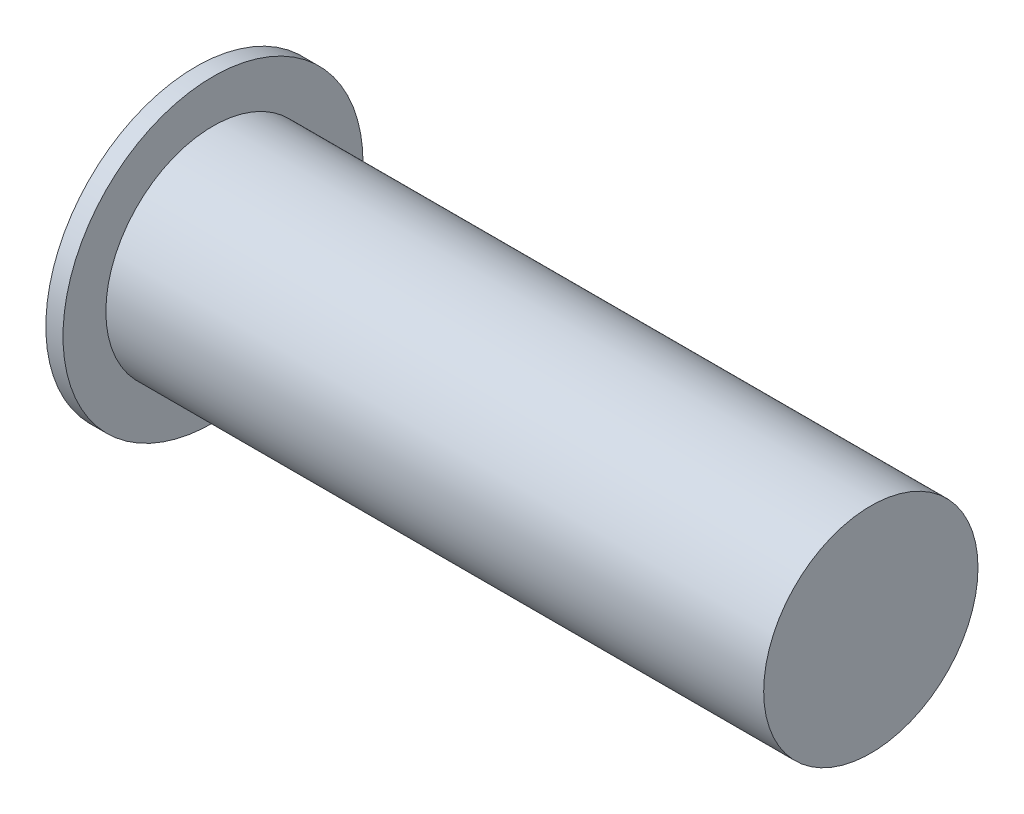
from build123d import *

# Parameters (mm, degrees)
SKETCH2_W          = 6.15375985
SKETCH2_H          = 0.730872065
CUT_EXTRUDE1_DEPTH = 0.254


with BuildPart() as part:
    # Sketch1 → Revolve1 (revolve)
    with BuildSketch(Plane(origin=(0, 0, 0), x_dir=(1, 0, 0), z_dir=(0, 1, 0)), mode=Mode.PRIVATE) as revolve1_sk:
        Polygon((0, 0), (-19.490008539, 0), (-19.490008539, -1.27), (-19.998008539, -1.27), (-19.998008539, 3.175), (-19.490008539, 3.175), (0, 3.175), align=None)
    revolve(revolve1_sk.sketch.rotate(Axis((0, 0, -3.175), (-1, 0, 0)), 180), axis=Axis((0, 0, -3.175), (-1, 0, 0)))

    # Sketch2 → Cut-Extrude1 (cut)
    with BuildSketch(Plane.ZY.offset(19.998008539)):
        with Locations((-3.076879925, -0.012747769)):
            Rectangle(SKETCH2_W, SKETCH2_H)
    extrude(amount=-CUT_EXTRUDE1_DEPTH, mode=Mode.SUBTRACT)


solid = part.part
